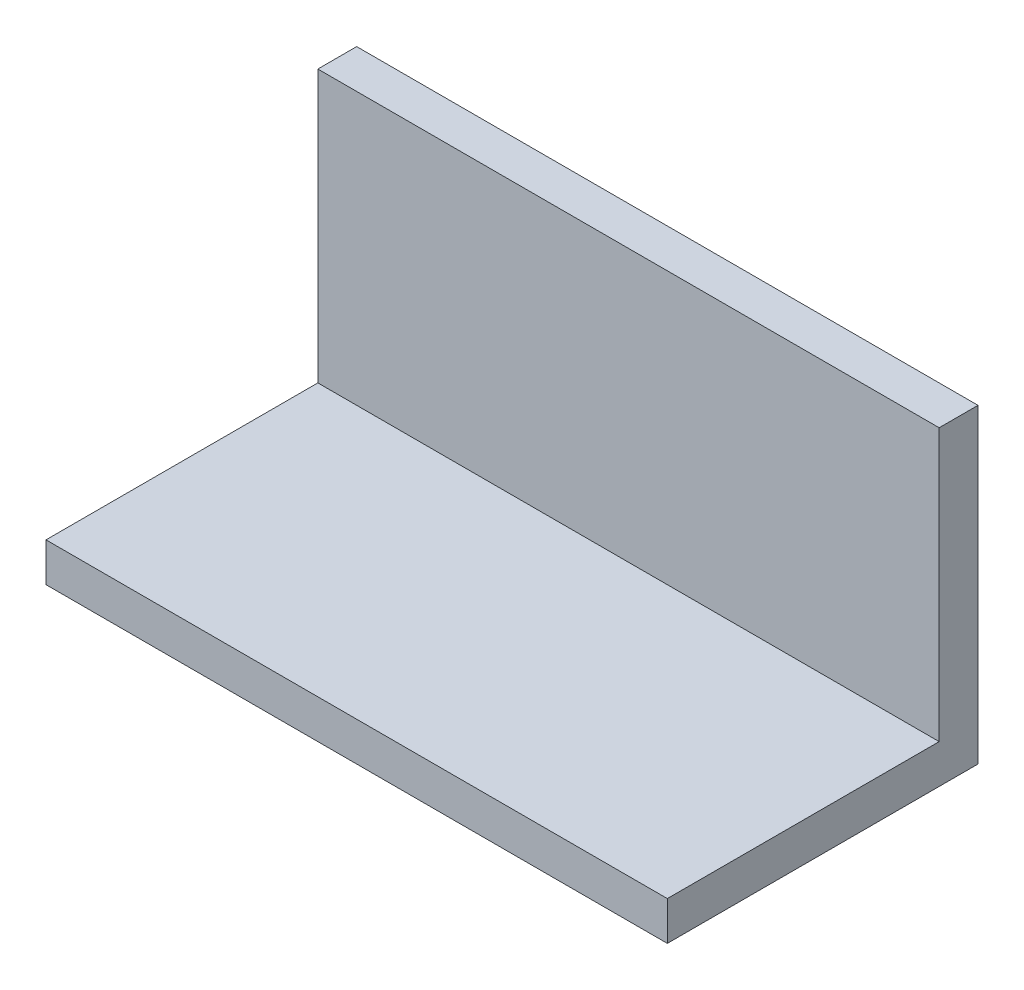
from build123d import *

# Parameters (mm, degrees)
BOSS_EXTRUDE1_DEPTH = 25.4


with BuildPart() as part:
    # Sketch1 → Boss-Extrude1 (new, symmetric)
    with BuildSketch(Plane(origin=(0, 0, 0), x_dir=(0, 0, -1), z_dir=(1, 0, 0))):
        Polygon((-12.7, -12.7), (12.7, -12.7), (12.7, 12.7), (9.525, 12.7), (9.525, 9.525), (9.525, -9.525), (-9.525, -9.525), (-12.7, -9.525), align=None)
    extrude(amount=BOSS_EXTRUDE1_DEPTH, both=True)


solid = part.part
